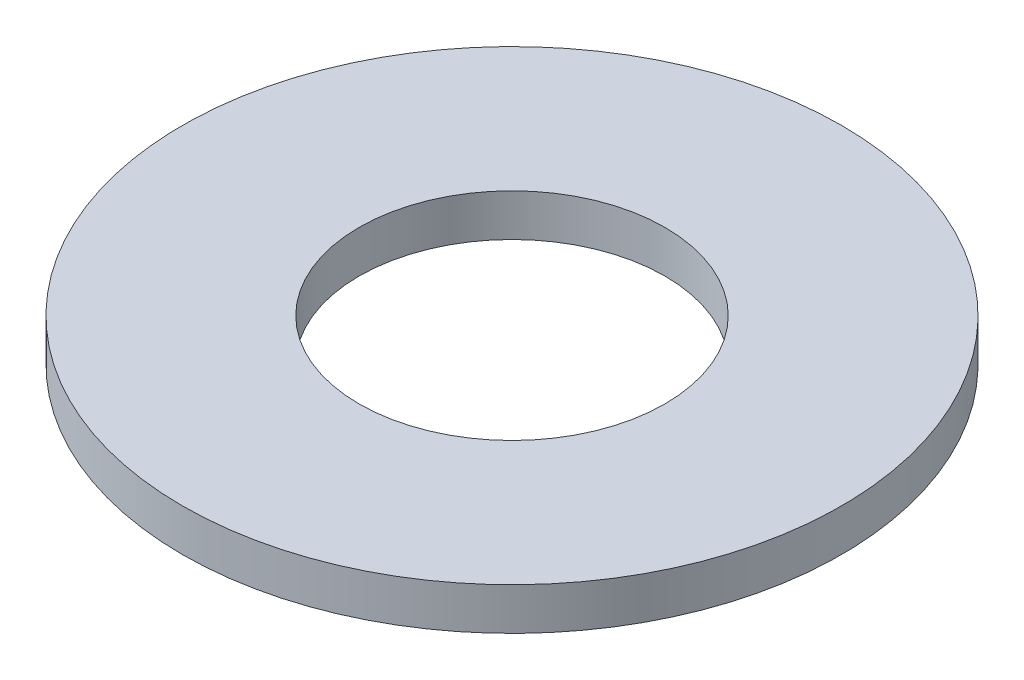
ISO-10303-21;
HEADER;
FILE_DESCRIPTION(('STEP AP214'),'2;1');
FILE_NAME('part.step','',(''),(''),'','','');
FILE_SCHEMA(('AUTOMOTIVE_DESIGN { 1 0 10303 214 1 1 1 1 }'));
ENDSEC;
DATA;
#1=APPLICATION_CONTEXT('core data for automotive mechanical design processes');
#2=APPLICATION_PROTOCOL_DEFINITION('international standard','automotive_design',2000,#1);
#3=PRODUCT_CONTEXT('',#1,'mechanical');
#4=PRODUCT('Part','Part','',(#3));
#5=PRODUCT_RELATED_PRODUCT_CATEGORY('part','',(#4));
#6=PRODUCT_DEFINITION_FORMATION('','',#4);
#7=PRODUCT_DEFINITION_CONTEXT('part definition',#1,'design');
#8=PRODUCT_DEFINITION('design','',#6,#7);
#9=PRODUCT_DEFINITION_SHAPE('','',#8);
#10=(LENGTH_UNIT() NAMED_UNIT(*) SI_UNIT(.MILLI.,.METRE.));
#11=(NAMED_UNIT(*) PLANE_ANGLE_UNIT() SI_UNIT($,.RADIAN.));
#12=(NAMED_UNIT(*) SI_UNIT($,.STERADIAN.) SOLID_ANGLE_UNIT());
#13=UNCERTAINTY_MEASURE_WITH_UNIT(LENGTH_MEASURE(1.E-05),#10,'distance_accuracy_value','');
#14=(GEOMETRIC_REPRESENTATION_CONTEXT(3) GLOBAL_UNCERTAINTY_ASSIGNED_CONTEXT((#13)) GLOBAL_UNIT_ASSIGNED_CONTEXT((#10,
#11,#12)) REPRESENTATION_CONTEXT('',''));
#15=CARTESIAN_POINT('',(0.,0.,0.));
#16=DIRECTION('',(0.,0.,1.));
#17=DIRECTION('',(1.,0.,0.));
#18=AXIS2_PLACEMENT_3D('',#15,#16,#17);
#19=CARTESIAN_POINT('',(0.,0.6096,0.));
#20=DIRECTION('',(0.,-1.,0.));
#21=DIRECTION('',(0.,0.,-1.));
#22=AXIS2_PLACEMENT_3D('',#19,#20,#21);
#23=CYLINDRICAL_SURFACE('',#22,4.7625);
#24=CARTESIAN_POINT('',(0.,0.6096,0.));
#25=DIRECTION('',(0.,1.,0.));
#26=DIRECTION('',(0.,0.,1.));
#27=AXIS2_PLACEMENT_3D('',#24,#25,#26);
#28=CIRCLE('',#27,4.7625);
#29=CARTESIAN_POINT('',(0.,0.6096,4.7625));
#30=VERTEX_POINT('',#29);
#31=EDGE_CURVE('E10',#30,#30,#28,.T.);
#32=ORIENTED_EDGE('',*,*,#31,.F.);
#33=EDGE_LOOP('',(#32));
#34=FACE_BOUND('',#33,.T.);
#35=CARTESIAN_POINT('',(0.,0.,0.));
#36=DIRECTION('',(0.,1.,0.));
#37=DIRECTION('',(0.,0.,1.));
#38=AXIS2_PLACEMENT_3D('',#35,#36,#37);
#39=CIRCLE('',#38,4.7625);
#40=CARTESIAN_POINT('',(0.,0.,4.7625));
#41=VERTEX_POINT('',#40);
#42=EDGE_CURVE('E35',#41,#41,#39,.T.);
#43=ORIENTED_EDGE('',*,*,#42,.T.);
#44=EDGE_LOOP('',(#43));
#45=FACE_BOUND('',#44,.T.);
#46=ADVANCED_FACE('F32',(#34,#45),#23,.T.);
#47=CARTESIAN_POINT('',(0.,0.6096,0.));
#48=DIRECTION('',(0.,1.,0.));
#49=DIRECTION('',(0.,0.,1.));
#50=AXIS2_PLACEMENT_3D('',#47,#48,#49);
#51=PLANE('',#50);
#52=CARTESIAN_POINT('',(0.,0.6096,0.));
#53=DIRECTION('',(0.,1.,0.));
#54=DIRECTION('',(0.,0.,1.));
#55=AXIS2_PLACEMENT_3D('',#52,#53,#54);
#56=CIRCLE('',#55,2.2098);
#57=CARTESIAN_POINT('',(0.,0.6096,2.2098));
#58=VERTEX_POINT('',#57);
#59=EDGE_CURVE('E44',#58,#58,#56,.T.);
#60=ORIENTED_EDGE('',*,*,#59,.F.);
#61=EDGE_LOOP('',(#60));
#62=FACE_BOUND('',#61,.T.);
#63=ORIENTED_EDGE('',*,*,#31,.T.);
#64=EDGE_LOOP('',(#63));
#65=FACE_BOUND('',#64,.T.);
#66=ADVANCED_FACE('F59',(#62,#65),#51,.T.);
#67=CARTESIAN_POINT('',(0.,0.,0.));
#68=DIRECTION('',(0.,1.,0.));
#69=DIRECTION('',(0.,0.,1.));
#70=AXIS2_PLACEMENT_3D('',#67,#68,#69);
#71=PLANE('',#70);
#72=CARTESIAN_POINT('',(0.,0.,0.));
#73=DIRECTION('',(0.,1.,0.));
#74=DIRECTION('',(0.,0.,1.));
#75=AXIS2_PLACEMENT_3D('',#72,#73,#74);
#76=CIRCLE('',#75,2.2098);
#77=CARTESIAN_POINT('',(0.,0.,2.2098));
#78=VERTEX_POINT('',#77);
#79=EDGE_CURVE('E42',#78,#78,#76,.T.);
#80=ORIENTED_EDGE('',*,*,#79,.T.);
#81=EDGE_LOOP('',(#80));
#82=FACE_BOUND('',#81,.T.);
#83=ORIENTED_EDGE('',*,*,#42,.F.);
#84=EDGE_LOOP('',(#83));
#85=FACE_BOUND('',#84,.T.);
#86=ADVANCED_FACE('F50',(#82,#85),#71,.F.);
#87=CARTESIAN_POINT('',(0.,0.,0.));
#88=DIRECTION('',(0.,1.,0.));
#89=DIRECTION('',(0.,0.,1.));
#90=AXIS2_PLACEMENT_3D('',#87,#88,#89);
#91=CYLINDRICAL_SURFACE('',#90,2.2098);
#92=ORIENTED_EDGE('',*,*,#79,.F.);
#93=EDGE_LOOP('',(#92));
#94=FACE_BOUND('',#93,.T.);
#95=ORIENTED_EDGE('',*,*,#59,.T.);
#96=EDGE_LOOP('',(#95));
#97=FACE_BOUND('',#96,.T.);
#98=ADVANCED_FACE('F53',(#94,#97),#91,.F.);
#99=CLOSED_SHELL('',(#46,#66,#86,#98));
#100=MANIFOLD_SOLID_BREP('B2',#99);
#101=ADVANCED_BREP_SHAPE_REPRESENTATION('',(#18,#100),#14);
#102=SHAPE_DEFINITION_REPRESENTATION(#9,#101);
ENDSEC;
END-ISO-10303-21;
